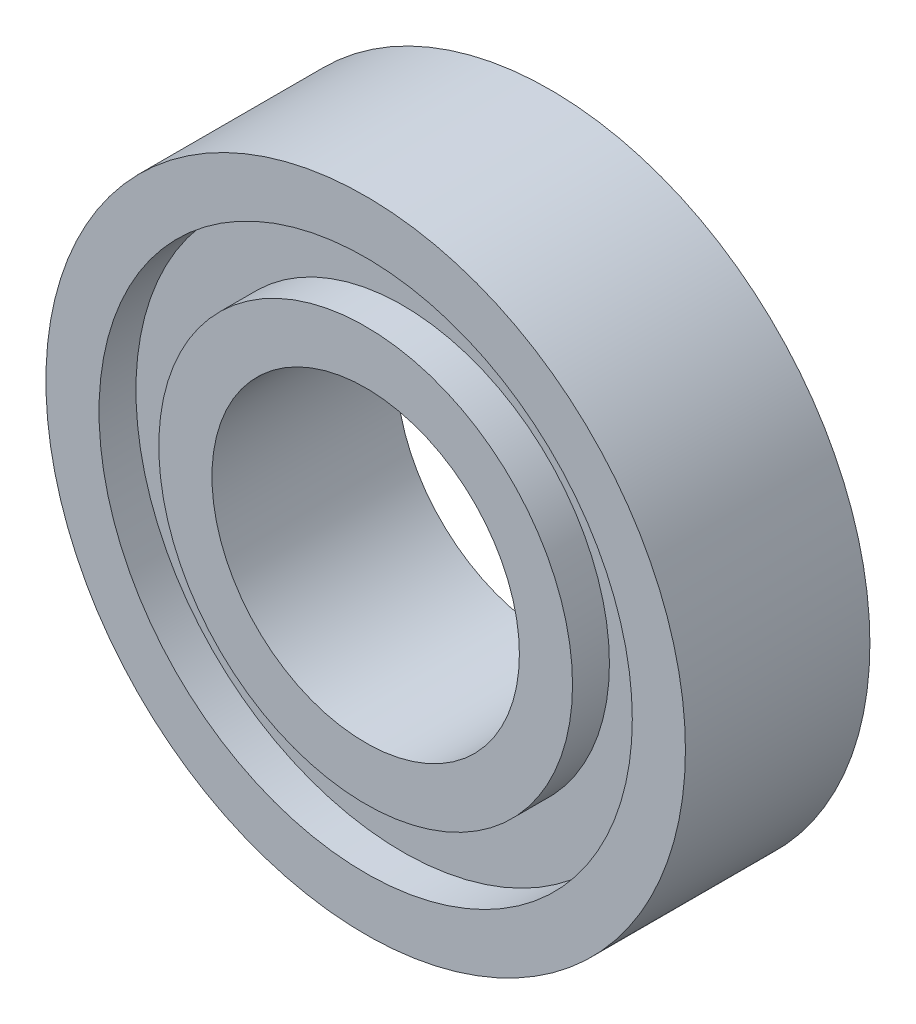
from build123d import *

# Parameters (mm, degrees)
SKIZZE1_R                       = 26
SKIZZE1_R_2                     = 21.68
AUFSATZ_LINEAR_AUSTRAGEN1_DEPTH = 7.5
SKIZZE2_R                       = 16.82
SKIZZE2_R_2                     = 12.5
AUFSATZ_LINEAR_AUSTRAGEN2_DEPTH = 7.5
SKIZZE3_R                       = 21.68
SKIZZE3_R_2                     = 16.57
AUFSATZ_LINEAR_AUSTRAGEN3_DEPTH = 4.5


with BuildPart() as part:
    # Skizze1 → Aufsatz-Linear austragen1 (new, symmetric)
    with BuildSketch(Plane.XY):
        Circle(SKIZZE1_R)
        Circle(SKIZZE1_R_2, mode=Mode.SUBTRACT)
    extrude(amount=AUFSATZ_LINEAR_AUSTRAGEN1_DEPTH, both=True)



with BuildPart() as body_2:
    # Skizze2 → Aufsatz-Linear austragen2 (new, symmetric)
    with BuildSketch(Plane.XY):
        Circle(SKIZZE2_R)
        Circle(SKIZZE2_R_2, mode=Mode.SUBTRACT)
    extrude(amount=AUFSATZ_LINEAR_AUSTRAGEN2_DEPTH, both=True)


with BuildPart() as part_1:
    add(part.part)

    add(body_2.part)  # Aufsatz-Linear austragen3 merges body 2
    # Skizze3 → Aufsatz-Linear austragen3 (add, symmetric)
    with BuildSketch(Plane.XY):
        Circle(SKIZZE3_R)
        Circle(SKIZZE3_R_2, mode=Mode.SUBTRACT)
    extrude(amount=AUFSATZ_LINEAR_AUSTRAGEN3_DEPTH, both=True)


solid = part_1.part
